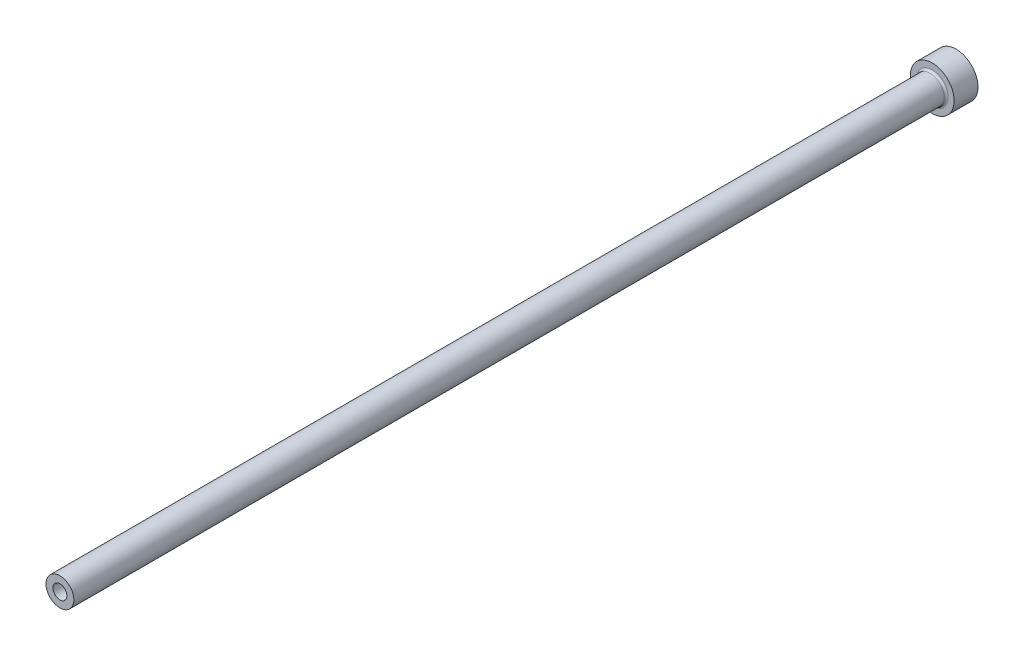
ISO-10303-21;
HEADER;
FILE_DESCRIPTION(('STEP AP214'),'2;1');
FILE_NAME('part.step','',(''),(''),'','','');
FILE_SCHEMA(('AUTOMOTIVE_DESIGN { 1 0 10303 214 1 1 1 1 }'));
ENDSEC;
DATA;
#1=APPLICATION_CONTEXT('core data for automotive mechanical design processes');
#2=APPLICATION_PROTOCOL_DEFINITION('international standard','automotive_design',2000,#1);
#3=PRODUCT_CONTEXT('',#1,'mechanical');
#4=PRODUCT('Part','Part','',(#3));
#5=PRODUCT_RELATED_PRODUCT_CATEGORY('part','',(#4));
#6=PRODUCT_DEFINITION_FORMATION('','',#4);
#7=PRODUCT_DEFINITION_CONTEXT('part definition',#1,'design');
#8=PRODUCT_DEFINITION('design','',#6,#7);
#9=PRODUCT_DEFINITION_SHAPE('','',#8);
#10=(LENGTH_UNIT() NAMED_UNIT(*) SI_UNIT(.MILLI.,.METRE.));
#11=(NAMED_UNIT(*) PLANE_ANGLE_UNIT() SI_UNIT($,.RADIAN.));
#12=(NAMED_UNIT(*) SI_UNIT($,.STERADIAN.) SOLID_ANGLE_UNIT());
#13=UNCERTAINTY_MEASURE_WITH_UNIT(LENGTH_MEASURE(1.E-05),#10,'distance_accuracy_value','');
#14=(GEOMETRIC_REPRESENTATION_CONTEXT(3) GLOBAL_UNCERTAINTY_ASSIGNED_CONTEXT((#13)) GLOBAL_UNIT_ASSIGNED_CONTEXT((#10,
#11,#12)) REPRESENTATION_CONTEXT('',''));
#15=CARTESIAN_POINT('',(0.,0.,0.));
#16=DIRECTION('',(0.,0.,1.));
#17=DIRECTION('',(1.,0.,0.));
#18=AXIS2_PLACEMENT_3D('',#15,#16,#17);
#19=CARTESIAN_POINT('',(0.,0.,225.));
#20=DIRECTION('',(0.,0.,-1.));
#21=DIRECTION('',(-1.,0.,0.));
#22=AXIS2_PLACEMENT_3D('',#19,#20,#21);
#23=PLANE('',#22);
#24=CARTESIAN_POINT('',(0.,0.,225.));
#25=DIRECTION('',(0.,0.,1.));
#26=DIRECTION('',(1.,0.,0.));
#27=AXIS2_PLACEMENT_3D('',#24,#25,#26);
#28=CIRCLE('',#27,1.74999999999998);
#29=CARTESIAN_POINT('',(1.74999999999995,0.,225.));
#30=VERTEX_POINT('',#29);
#31=EDGE_CURVE('E63',#30,#30,#28,.T.);
#32=ORIENTED_EDGE('',*,*,#31,.F.);
#33=EDGE_LOOP('',(#32));
#34=FACE_BOUND('',#33,.T.);
#35=CARTESIAN_POINT('',(0.,0.,225.));
#36=DIRECTION('',(0.,0.,1.));
#37=DIRECTION('',(1.,0.,0.));
#38=AXIS2_PLACEMENT_3D('',#35,#36,#37);
#39=CIRCLE('',#38,3.49999999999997);
#40=CARTESIAN_POINT('',(3.49999999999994,0.,225.));
#41=VERTEX_POINT('',#40);
#42=EDGE_CURVE('E54',#41,#41,#39,.T.);
#43=ORIENTED_EDGE('',*,*,#42,.T.);
#44=EDGE_LOOP('',(#43));
#45=FACE_BOUND('',#44,.T.);
#46=ADVANCED_FACE('F34',(#34,#45),#23,.F.);
#47=CARTESIAN_POINT('',(0.,0.,225.));
#48=DIRECTION('',(0.,0.,1.));
#49=DIRECTION('',(1.,0.,0.));
#50=AXIS2_PLACEMENT_3D('',#47,#48,#49);
#51=CYLINDRICAL_SURFACE('',#50,3.49999999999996);
#52=CARTESIAN_POINT('',(0.,0.,6.50000000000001));
#53=DIRECTION('',(0.,0.,1.));
#54=DIRECTION('',(1.,0.,0.));
#55=AXIS2_PLACEMENT_3D('',#52,#53,#54);
#56=CIRCLE('',#55,3.49999999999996);
#57=CARTESIAN_POINT('',(3.49999999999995,0.,6.50000000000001));
#58=VERTEX_POINT('',#57);
#59=EDGE_CURVE('E49',#58,#58,#56,.T.);
#60=ORIENTED_EDGE('',*,*,#59,.T.);
#61=EDGE_LOOP('',(#60));
#62=FACE_BOUND('',#61,.T.);
#63=ORIENTED_EDGE('',*,*,#42,.F.);
#64=EDGE_LOOP('',(#63));
#65=FACE_BOUND('',#64,.T.);
#66=ADVANCED_FACE('F92',(#62,#65),#51,.T.);
#67=CARTESIAN_POINT('',(0.,0.,6.));
#68=DIRECTION('',(0.,0.,1.));
#69=DIRECTION('',(1.,0.,0.));
#70=AXIS2_PLACEMENT_3D('',#67,#68,#69);
#71=PLANE('',#70);
#72=CARTESIAN_POINT('',(0.,0.,6.));
#73=DIRECTION('',(0.,0.,1.));
#74=DIRECTION('',(1.,0.,0.));
#75=AXIS2_PLACEMENT_3D('',#72,#73,#74);
#76=CIRCLE('',#75,3.99999999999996);
#77=CARTESIAN_POINT('',(3.99999999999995,0.,6.));
#78=VERTEX_POINT('',#77);
#79=EDGE_CURVE('E45',#78,#78,#76,.F.);
#80=ORIENTED_EDGE('',*,*,#79,.T.);
#81=EDGE_LOOP('',(#80));
#82=FACE_BOUND('',#81,.T.);
#83=CARTESIAN_POINT('',(0.,0.,6.00000000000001));
#84=DIRECTION('',(0.,0.,1.));
#85=DIRECTION('',(1.,0.,0.));
#86=AXIS2_PLACEMENT_3D('',#83,#84,#85);
#87=CIRCLE('',#86,5.49999999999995);
#88=CARTESIAN_POINT('',(5.49999999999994,0.,6.00000000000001));
#89=VERTEX_POINT('',#88);
#90=EDGE_CURVE('E57',#89,#89,#87,.T.);
#91=ORIENTED_EDGE('',*,*,#90,.T.);
#92=EDGE_LOOP('',(#91));
#93=FACE_BOUND('',#92,.T.);
#94=ADVANCED_FACE('F98',(#82,#93),#71,.T.);
#95=CARTESIAN_POINT('',(0.,0.,225.));
#96=DIRECTION('',(0.,0.,1.));
#97=DIRECTION('',(1.,0.,0.));
#98=AXIS2_PLACEMENT_3D('',#95,#96,#97);
#99=CYLINDRICAL_SURFACE('',#98,5.49999999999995);
#100=ORIENTED_EDGE('',*,*,#90,.F.);
#101=EDGE_LOOP('',(#100));
#102=FACE_BOUND('',#101,.T.);
#103=CARTESIAN_POINT('',(0.,0.,0.));
#104=DIRECTION('',(0.,0.,1.));
#105=DIRECTION('',(1.,0.,0.));
#106=AXIS2_PLACEMENT_3D('',#103,#104,#105);
#107=CIRCLE('',#106,5.49999999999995);
#108=CARTESIAN_POINT('',(5.49999999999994,0.,0.));
#109=VERTEX_POINT('',#108);
#110=EDGE_CURVE('E60',#109,#109,#107,.T.);
#111=ORIENTED_EDGE('',*,*,#110,.T.);
#112=EDGE_LOOP('',(#111));
#113=FACE_BOUND('',#112,.T.);
#114=ADVANCED_FACE('F89',(#102,#113),#99,.T.);
#115=CARTESIAN_POINT('',(0.,0.,0.));
#116=DIRECTION('',(0.,0.,1.));
#117=DIRECTION('',(1.,0.,0.));
#118=AXIS2_PLACEMENT_3D('',#115,#116,#117);
#119=PLANE('',#118);
#120=CARTESIAN_POINT('',(0.,0.,0.));
#121=DIRECTION('',(0.,0.,1.));
#122=DIRECTION('',(1.,0.,0.));
#123=AXIS2_PLACEMENT_3D('',#120,#121,#122);
#124=CIRCLE('',#123,2.49999999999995);
#125=CARTESIAN_POINT('',(2.49999999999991,0.,0.));
#126=VERTEX_POINT('',#125);
#127=EDGE_CURVE('E41',#126,#126,#124,.T.);
#128=ORIENTED_EDGE('',*,*,#127,.T.);
#129=EDGE_LOOP('',(#128));
#130=FACE_BOUND('',#129,.T.);
#131=ORIENTED_EDGE('',*,*,#110,.F.);
#132=EDGE_LOOP('',(#131));
#133=FACE_BOUND('',#132,.T.);
#134=ADVANCED_FACE('F83',(#130,#133),#119,.F.);
#135=CARTESIAN_POINT('',(0.,0.,225.));
#136=DIRECTION('',(0.,0.,1.));
#137=DIRECTION('',(1.,0.,0.));
#138=AXIS2_PLACEMENT_3D('',#135,#136,#137);
#139=CYLINDRICAL_SURFACE('',#138,1.74999999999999);
#140=ORIENTED_EDGE('',*,*,#31,.T.);
#141=EDGE_LOOP('',(#140));
#142=FACE_BOUND('',#141,.T.);
#143=CARTESIAN_POINT('',(0.,0.,125.));
#144=DIRECTION('',(0.,0.,1.));
#145=DIRECTION('',(1.,0.,0.));
#146=AXIS2_PLACEMENT_3D('',#143,#144,#145);
#147=CIRCLE('',#146,1.74999999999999);
#148=CARTESIAN_POINT('',(1.74999999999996,0.,125.));
#149=VERTEX_POINT('',#148);
#150=EDGE_CURVE('E66',#149,#149,#147,.T.);
#151=ORIENTED_EDGE('',*,*,#150,.F.);
#152=EDGE_LOOP('',(#151));
#153=FACE_BOUND('',#152,.T.);
#154=ADVANCED_FACE('F78',(#142,#153),#139,.F.);
#155=CARTESIAN_POINT('',(0.,0.,125.));
#156=DIRECTION('',(0.,0.,-1.));
#157=DIRECTION('',(-1.,0.,0.));
#158=AXIS2_PLACEMENT_3D('',#155,#156,#157);
#159=CONICAL_SURFACE('',#158,1.74999999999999,0.523598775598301);
#160=CARTESIAN_POINT('',(0.,0.,124.566987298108));
#161=DIRECTION('',(0.,0.,1.));
#162=DIRECTION('',(1.,0.,0.));
#163=AXIS2_PLACEMENT_3D('',#160,#161,#162);
#164=CIRCLE('',#163,1.99999999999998);
#165=CARTESIAN_POINT('',(1.99999999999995,0.,124.566987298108));
#166=VERTEX_POINT('',#165);
#167=EDGE_CURVE('E69',#166,#166,#164,.T.);
#168=ORIENTED_EDGE('',*,*,#167,.F.);
#169=EDGE_LOOP('',(#168));
#170=FACE_BOUND('',#169,.T.);
#171=ORIENTED_EDGE('',*,*,#150,.T.);
#172=EDGE_LOOP('',(#171));
#173=FACE_BOUND('',#172,.T.);
#174=ADVANCED_FACE('F75',(#170,#173),#159,.F.);
#175=CARTESIAN_POINT('',(0.,0.,225.));
#176=DIRECTION('',(0.,0.,1.));
#177=DIRECTION('',(1.,0.,0.));
#178=AXIS2_PLACEMENT_3D('',#175,#176,#177);
#179=CYLINDRICAL_SURFACE('',#178,1.99999999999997);
#180=CARTESIAN_POINT('',(0.,0.,0.499999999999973));
#181=DIRECTION('',(0.,0.,1.));
#182=DIRECTION('',(1.,0.,0.));
#183=AXIS2_PLACEMENT_3D('',#180,#181,#182);
#184=CIRCLE('',#183,1.99999999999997);
#185=CARTESIAN_POINT('',(1.99999999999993,0.,0.499999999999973));
#186=VERTEX_POINT('',#185);
#187=EDGE_CURVE('E10',#186,#186,#184,.F.);
#188=ORIENTED_EDGE('',*,*,#187,.T.);
#189=EDGE_LOOP('',(#188));
#190=FACE_BOUND('',#189,.T.);
#191=ORIENTED_EDGE('',*,*,#167,.T.);
#192=EDGE_LOOP('',(#191));
#193=FACE_BOUND('',#192,.T.);
#194=ADVANCED_FACE('F73',(#190,#193),#179,.F.);
#195=CARTESIAN_POINT('',(0.,0.,6.50000000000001));
#196=DIRECTION('',(0.,0.,1.));
#197=DIRECTION('',(1.,0.,0.));
#198=AXIS2_PLACEMENT_3D('',#195,#196,#197);
#199=TOROIDAL_SURFACE('',#198,3.99999999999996,0.5);
#200=ORIENTED_EDGE('',*,*,#79,.F.);
#201=EDGE_LOOP('',(#200));
#202=FACE_BOUND('',#201,.T.);
#203=ORIENTED_EDGE('',*,*,#59,.F.);
#204=EDGE_LOOP('',(#203));
#205=FACE_BOUND('',#204,.T.);
#206=ADVANCED_FACE('F104',(#202,#205),#199,.F.);
#207=CARTESIAN_POINT('',(0.,0.,0.));
#208=DIRECTION('',(0.,0.,-1.));
#209=DIRECTION('',(-1.,0.,0.));
#210=AXIS2_PLACEMENT_3D('',#207,#208,#209);
#211=CONICAL_SURFACE('',#210,2.49999999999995,0.785398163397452);
#212=ORIENTED_EDGE('',*,*,#187,.F.);
#213=EDGE_LOOP('',(#212));
#214=FACE_BOUND('',#213,.T.);
#215=ORIENTED_EDGE('',*,*,#127,.F.);
#216=EDGE_LOOP('',(#215));
#217=FACE_BOUND('',#216,.T.);
#218=ADVANCED_FACE('F36',(#214,#217),#211,.F.);
#219=CLOSED_SHELL('',(#46,#66,#94,#114,#134,#154,#174,#194,#206,#218));
#220=MANIFOLD_SOLID_BREP('B2',#219);
#221=ADVANCED_BREP_SHAPE_REPRESENTATION('',(#18,#220),#14);
#222=SHAPE_DEFINITION_REPRESENTATION(#9,#221);
ENDSEC;
END-ISO-10303-21;
